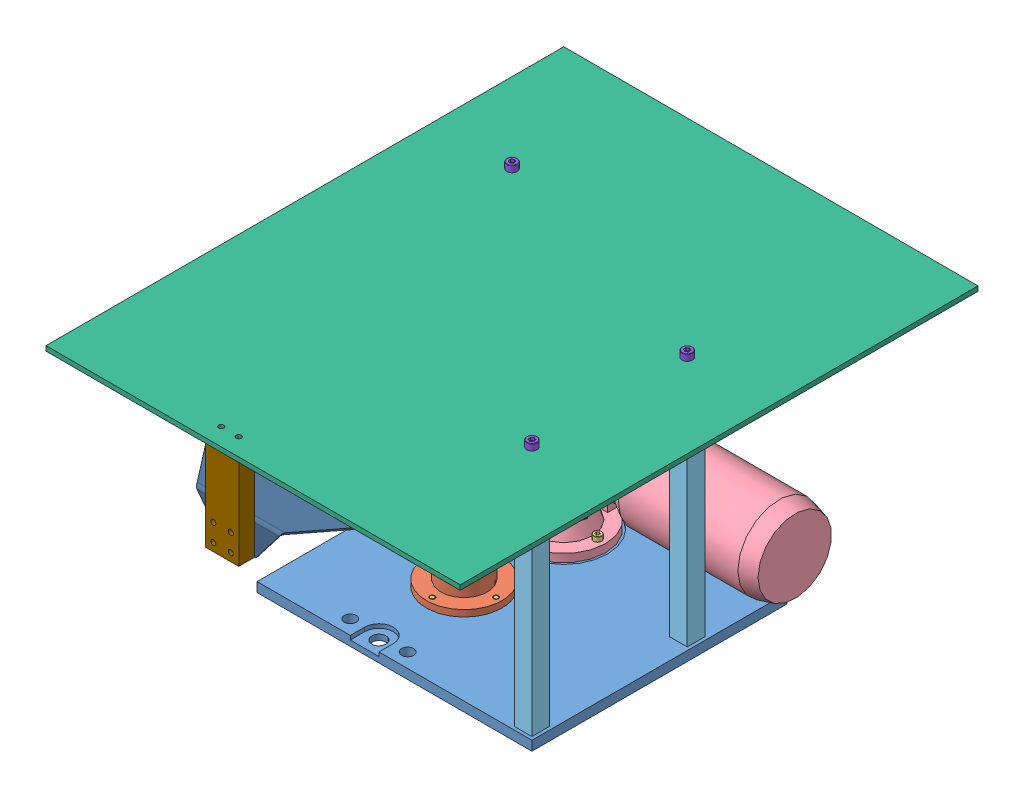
SolidWorks assembly Bati.SLDASM, configuration Défaut (file format 10000). Lengths in mm.
Overall size (520 332 650).
23 component instances, 10 part files, 55 mates.
Components (placement in the parent):
- plaque de base-1: plaque de base.SLDPRT [Défaut] at (70 12 -30) x (-1 0 0) z (0 -1 0) size (345 320 12)
- boitier-1: boitier.SLDPRT [Défaut] at (0 7 125) x (0 1 0) z (-1 0 0) size (110 95 95)
- vis M6x20-1: vis M6x20.SLDPRT [Défaut] at (40 20 125) x (-1 0 0) z (0 -1 0) size (10 10 26)
- vis M6x20-2: vis M6x20.SLDPRT [Défaut] at (-0.3589 20 85) x (-1 0 0) z (0 -1 0) size (10 10 26)
- vis M6x20-3: vis M6x20.SLDPRT [Défaut] at (-0.3589 20 165) x (-1 0 0) z (0 -1 0) size (10 10 26)
- vis M6x20-4: vis M6x20.SLDPRT [Défaut] at (-40 20 125) x (-1 0 0) z (0 -1 0) size (10 10 26)
- motoreducteur-1: motoreducteur.SLDPRT [Défaut] at (0 7 0) x (0 0 1) z (1 0 0) size (144.05 131.55 310)
- vis M6x20-5: vis M6x20.SLDPRT [Défaut] at (42.5 2 0) x (0.621331 0 0.783548) z (0 1 0) size (10 10 26)
- vis M6x20-6: vis M6x20.SLDPRT [Défaut] at (0 2 -42.5) x (0.811012 0 0.58503) z (0 1 0) size (10 10 26)
- vis M6x20-7: vis M6x20.SLDPRT [Défaut] at (0 2 42.5) x (0.87491 0 0.484286) z (0 1 0) size (10 10 26)
- vis M6x20-8: vis M6x20.SLDPRT [Défaut] at (-42.5 2 0) x (0.634351 0 0.773045) z (0 1 0) size (10 10 26)
- pied-1: pied.SLDPRT [Défaut] at (206 310 246) x (-1 0 0) z (0 -1 0) size (22 22 298)
- pied-2: pied.SLDPRT [Défaut] at (206 310 51) x (-1 0 0) z (0 -1 0) size (22 22 298)
- pied-3: pied.SLDPRT [Défaut] at (-109 310 -44) x (-1 0 0) z (0 -1 0) size (22 22 298)
- bati-1: bati.SLDPRT [Défaut] at (300 316 430) x (-1 0 0) z (0 -1 0) size (520 650 6)
- vis M8x25-1: vis M8x25.SLDPRT [Défaut] at (195 25 40) x (-1 0 0) z (0 -1 0) size (13 13 33)
- vis M8x25-2: vis M8x25.SLDPRT [Défaut] at (195 25 235) x (-1 0 0) z (0 -1 0) size (13 13 33)
- vis M8x25-3: vis M8x25.SLDPRT [Défaut] at (-120 25 -55) x (-1 0 0) z (0 -1 0) size (13 13 33)
- vis M8x20-1: vis M8x20.SLDPRT [Défaut] at (195 296 40) x (0.923728 0 0.383049) z (0 1 0) size (13 13 28)
- vis M8x20-2: vis M8x20.SLDPRT [Défaut] at (195 296 235) x (0.923728 0 0.383049) z (0 1 0) size (13 13 28)
- vis M8x20-3: vis M8x20.SLDPRT [Défaut] at (-120 296 -55) x (0.923728 0 0.383049) z (0 1 0) size (13 13 28)
- support-1: support.SLDPRT [Défaut] at (-32 185 418) x (1 0 0) z (0 1 0) size (42 20 125)
- rampe-1: rampe.SLDPRT [Défaut] at (-11 224.6438 146.3562) x (0 0 1) z (1 0 0) size (251.65 79.64 400)
Mates (geometry in assembly coordinates):
- Coaxial1: concentric anti-aligned: cylinder of plaque de base-1 through (0 0 125) axis (0 1 0) radius 30; cylinder of boitier-1 through (0 -16.2546 125) axis (0 -1 0) radius 30
- Coaxial2: concentric aligned: cylinder of plaque de base-1 through (40 0 125) axis (0 -1 0) radius 3; cylinder of boitier-1 through (40 10 125) axis (0 -1 0) radius 3.3
- Coïncidente1: coincident anti-aligned: plane of plaque de base-1 through (0 10 125) normal (0 1 0); plane of boitier-1 through (0 10 95) normal (0 -1 0)
- Coaxial3: concentric anti-aligned: cylinder of plaque de base-1 through (-0.3589 0 85) axis (0 -1 0) radius 3; cylinder of vis M6x20-2 through (-0.3589 0 85) axis (0 1 0) radius 3
- Coaxial4: concentric anti-aligned: cylinder of plaque de base-1 through (40 0 125) axis (0 -1 0) radius 3; cylinder of vis M6x20-1 through (40 0 125) axis (0 1 0) radius 3
- Coaxial5: concentric anti-aligned: cylinder of plaque de base-1 through (-0.3589 0 165) axis (0 -1 0) radius 3; cylinder of vis M6x20-3 through (-0.3589 0 165) axis (0 1 0) radius 3
- Coaxial6: concentric anti-aligned: cylinder of plaque de base-1 through (-40 0 125) axis (0 -1 0) radius 3; cylinder of vis M6x20-4 through (-40 0 125) axis (0 1 0) radius 3
- Coïncidente2: coincident anti-aligned: plane of plaque de base-1 through (210 0 -70) normal (0 -1 0); plane of vis M6x20-4 through (-40 0 125) normal (0 1 0)
- Coïncidente3: coincident anti-aligned: plane of plaque de base-1 through (210 0 -70) normal (0 -1 0); plane of vis M6x20-3 through (-0.3589 0 165) normal (0 1 0)
- Coïncidente4: coincident anti-aligned: plane of plaque de base-1 through (210 0 -70) normal (0 -1 0); plane of vis M6x20-1 through (40 0 125) normal (0 1 0)
- Coïncidente5: coincident anti-aligned: plane of plaque de base-1 through (210 0 -70) normal (0 -1 0); plane of vis M6x20-2 through (-0.3589 0 85) normal (0 1 0)
- Coaxial7: concentric anti-aligned: cylinder of plaque de base-1 through (0 0 0) axis (0 1 0) radius 35; cylinder of motoreducteur-1 through (0 -25.3842 0) axis (0 -1 0) radius 35
- Coïncidente6: coincident anti-aligned: plane of plaque de base-1 through (210 12 -70) normal (0 1 0); plane of motoreducteur-1 through (0 12 35) normal (0 -1 0)
- Coaxial8: concentric aligned: cylinder of plaque de base-1 through (42.5 0 0) axis (0 -1 0) radius 3; cylinder of motoreducteur-1 through (42.5 12 0) axis (0 -1 0) radius 3.3
- Coaxial10: concentric aligned: cylinder of motoreducteur-1 through (-42.5 12 0) axis (0 -1 0) radius 3.3; cylinder of vis M6x20-8 through (-42.5 22 0) axis (0 -1 0) radius 3
- Coaxial11: concentric aligned: cylinder of motoreducteur-1 through (0 12 42.5) axis (0 -1 0) radius 3.3; cylinder of vis M6x20-7 through (0 22 42.5) axis (0 -1 0) radius 3
- Coaxial12: concentric aligned: cylinder of motoreducteur-1 through (0 12 -42.5) axis (0 -1 0) radius 3.3; cylinder of vis M6x20-6 through (0 22 -42.5) axis (0 -1 0) radius 3
- Coaxial13: concentric aligned: cylinder of motoreducteur-1 through (42.5 12 0) axis (0 -1 0) radius 3.3; cylinder of vis M6x20-5 through (42.5 22 0) axis (0 -1 0) radius 3
- Coïncidente7: coincident anti-aligned: plane of motoreducteur-1 through (0 22 52.5) normal (0 1 0); plane of vis M6x20-5 through (42.5 22 0) normal (0 -1 0)
- Coïncidente8: coincident anti-aligned: plane of motoreducteur-1 through (0 22 52.5) normal (0 1 0); plane of vis M6x20-6 through (0 22 -42.5) normal (0 -1 0)
- Coïncidente9: coincident anti-aligned: plane of motoreducteur-1 through (0 22 52.5) normal (0 1 0); plane of vis M6x20-8 through (-42.5 22 0) normal (0 -1 0)
- Coïncidente10: coincident anti-aligned: plane of motoreducteur-1 through (0 22 52.5) normal (0 1 0); plane of vis M6x20-7 through (0 22 42.5) normal (0 -1 0)
- Coaxial14: concentric anti-aligned: cylinder of plaque de base-1 through (-120 0 -55) axis (0 1 0) radius 4.5; cylinder of pied-3 through (-120 37 -55) axis (0 -1 0) radius 3.375
- Coïncidente11: coincident anti-aligned: plane of plaque de base-1 through (210 12 -70) normal (0 1 0); plane of pied-3 through (-109 12 -66) normal (0 -1 0)
- Parallèle1: parallel aligned: plane of plaque de base-1 through (-135 0 -70) normal (-1 0 0); plane of pied-3 through (-131 12 -44) normal (-1 0 0)
- Coaxial15: concentric anti-aligned: cylinder of plaque de base-1 through (195 0 40) axis (0 1 0) radius 4.5; cylinder of pied-2 through (195 37 40) axis (0 -1 0) radius 3.375
- Coïncidente12: coincident anti-aligned: plane of plaque de base-1 through (210 12 -70) normal (0 1 0); plane of pied-2 through (206 12 29) normal (0 -1 0)
- Parallèle2: parallel aligned: plane of plaque de base-1 through (210 0 -70) normal (1 0 0); plane of pied-2 through (206 12 51) normal (1 0 0)
- Coaxial16: concentric anti-aligned: cylinder of plaque de base-1 through (195 0 235) axis (0 1 0) radius 4.5; cylinder of pied-1 through (195 37 235) axis (0 -1 0) radius 3.375
- Coïncidente13: coincident anti-aligned: plane of plaque de base-1 through (210 12 -70) normal (0 1 0); plane of pied-1 through (206 12 224) normal (0 -1 0)
- Parallèle3: parallel aligned: plane of plaque de base-1 through (210 0 -70) normal (1 0 0); plane of pied-1 through (206 12 246) normal (1 0 0)
- Coïncidente14: coincident anti-aligned: plane of pied-1 through (206 310 224) normal (0 1 0); plane of bati-1 through (300 310 -220) normal (0 -1 0)
- Coaxial17: concentric anti-aligned: cylinder of pied-1 through (195 285 235) axis (0 1 0) radius 3.375; cylinder of bati-1 through (195 316.001 235) axis (0 -1 0) radius 4.25
- Coaxial18: concentric anti-aligned: cylinder of pied-2 through (195 285 40) axis (0 1 0) radius 3.375; cylinder of bati-1 through (195 316.001 40) axis (0 -1 0) radius 4.25
- Coaxial19: concentric aligned: cylinder of plaque de base-1 through (195 0 40) axis (0 1 0) radius 4.5; cylinder of vis M8x25-1 through (195 0 40) axis (0 1 0) radius 4
- Coïncidente15: coincident anti-aligned: plane of plaque de base-1 through (210 0 -70) normal (0 -1 0); plane of vis M8x25-1 through (195 0 40) normal (0 1 0)
- Coaxial20: concentric aligned: cylinder of plaque de base-1 through (195 0 235) axis (0 1 0) radius 4.5; cylinder of vis M8x25-2 through (195 0 235) axis (0 1 0) radius 4
- Coïncidente16: coincident anti-aligned: plane of plaque de base-1 through (210 0 -70) normal (0 -1 0); plane of vis M8x25-2 through (195 0 235) normal (0 1 0)
- Coaxial22: concentric aligned: cylinder of plaque de base-1 through (-120 0 -55) axis (0 1 0) radius 4.5; cylinder of vis M8x25-3 through (-120 0 -55) axis (0 1 0) radius 4
- Coïncidente17: coincident anti-aligned: plane of plaque de base-1 through (210 0 -70) normal (0 -1 0); plane of vis M8x25-3 through (-120 0 -55) normal (0 1 0)
- Coaxial23: concentric aligned: cylinder of bati-1 through (195 316.001 235) axis (0 -1 0) radius 4.25; cylinder of vis M8x20-2 through (195 316 235) axis (0 -1 0) radius 4
- Coïncidente18: coincident anti-aligned: plane of bati-1 through (300 316 -220) normal (0 1 0); plane of vis M8x20-2 through (195 316 235) normal (0 -1 0)
- Coaxial24: concentric aligned: cylinder of bati-1 through (195 316.001 40) axis (0 -1 0) radius 4.25; cylinder of vis M8x20-1 through (195 316 40) axis (0 -1 0) radius 4
- Coïncidente19: coincident anti-aligned: plane of bati-1 through (300 316 -220) normal (0 1 0); plane of vis M8x20-1 through (195 316 40) normal (0 -1 0)
- Coaxial25: concentric aligned: cylinder of bati-1 through (-120 316.001 -55) axis (0 -1 0) radius 4.25; cylinder of vis M8x20-3 through (-120 316 -55) axis (0 -1 0) radius 4
- Coïncidente20: coincident anti-aligned: plane of bati-1 through (300 316 -220) normal (0 1 0); plane of vis M8x20-3 through (-120 316 -55) normal (0 -1 0)
- Coïncidente21: coincident anti-aligned: plane of bati-1 through (300 310 -220) normal (0 -1 0); plane of support-1 through (-32 310 398) normal (0 1 0)
- Coaxial26: concentric anti-aligned: cylinder of bati-1 through (-22 316.001 408) axis (0 -1 0) radius 3.25; cylinder of support-1 through (-22 285 408) axis (0 1 0) radius 3.375
- Coaxial27: concentric anti-aligned: cylinder of bati-1 through (0 316.001 408) axis (0 -1 0) radius 3.25; cylinder of support-1 through (0 285 408) axis (0 1 0) radius 3.375
- Coïncidente22: coincident anti-aligned: plane of support-1 through (-32 310 398) normal (0 0 -1); plane of rampe-1 through (189 475 398) normal (0 0 1)
- Coaxial28: concentric anti-aligned: cylinder of support-1 through (0 195 418.001) axis (0 0 -1) radius 3.25; cylinder of rampe-1 through (0 195 146.3552) axis (0 0 1) radius 3.25
- Coaxial29: concentric anti-aligned: cylinder of support-1 through (-22 217 418.001) axis (0 0 -1) radius 3.25; cylinder of rampe-1 through (-22 217 146.3552) axis (0 0 1) radius 3.25
- Coïncidente23: coincident anti-aligned: plane of plaque de base-1 through (210 0 -70) normal (0 -1 0); plane of assembly through (0 0 0) normal (0 1 0)
- Coïncidente27: coincident: line of plaque de base-1 through (0 0 0) axis (0 1 0); point of assembly
- Parallèle4: parallel aligned: plane of plaque de base-1 through (210 0 250) normal (0 0 1); plane of assembly
